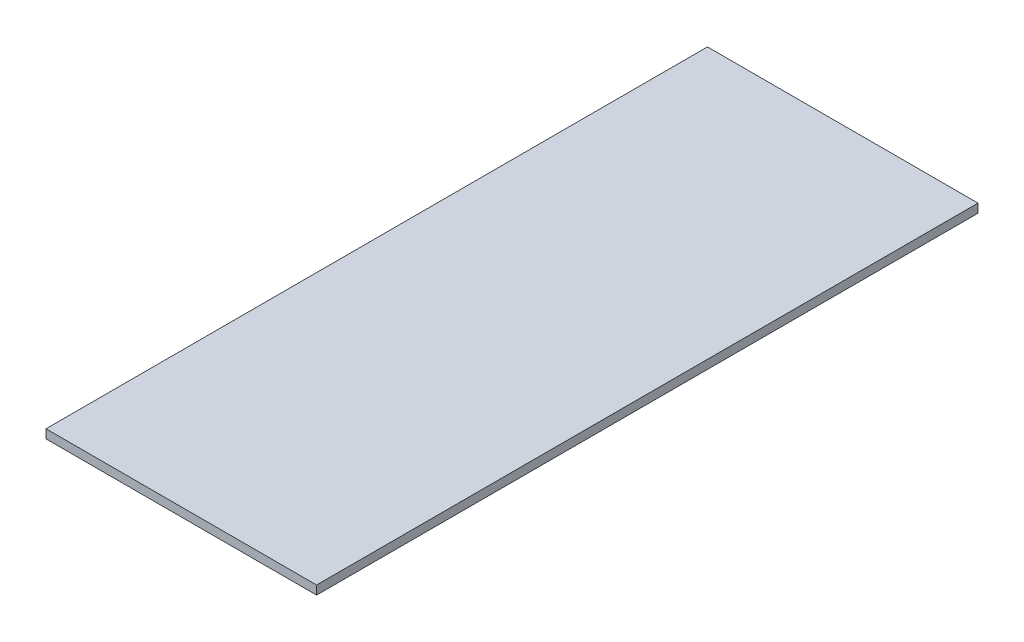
from build123d import *

# Parameters (mm, degrees)
SKETCH1_W           = 171.45
SKETCH1_H           = 419.1
BOSS_EXTRUDE1_DEPTH = 5.55625


with BuildPart() as part:
    # Sketch1 → Boss-Extrude1 (new body)
    with BuildSketch(Plane(origin=(0, 0, 0), x_dir=(1, 0, 0), z_dir=(0, 1, 0))):
        Rectangle(SKETCH1_W, SKETCH1_H)
    extrude(amount=BOSS_EXTRUDE1_DEPTH)


solid = part.part
